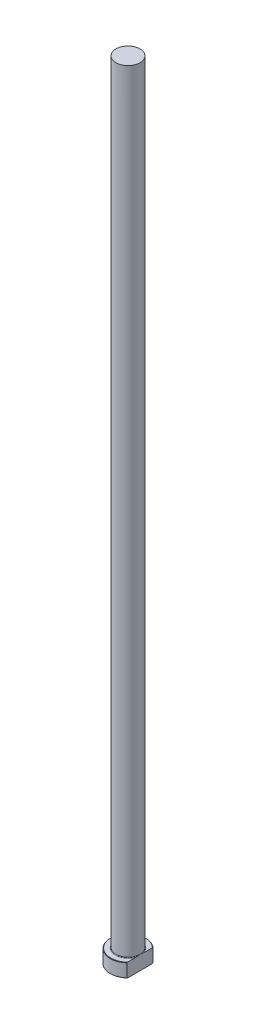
from build123d import *
from build123d.topology import SkipClean

# Parameters (mm, degrees)
CHAMFER1_SIZE = 0.2
FILLET1_R     = 0.3
KEY_DEPTH     = 401.202448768


with BuildPart() as part:
    # Sketch1 → Revolve1 (revolve)
    with BuildSketch(Plane.XY, mode=Mode.PRIVATE) as revolve1_sk:
        Polygon((0, 0), (-9, 0), (-9, 7), (-6.1, 7), (-6.1, 400), (0, 400), align=None)
    revolve(revolve1_sk.sketch.rotate(Axis((0, 259.958771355, 0), (0, -1, 0)), 270), axis=Axis((0, 259.958771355, 0), (0, -1, 0)))

    # Chamfer1
    chamfer1_edges = [part.edges().sort_by_distance(p)[0] for p in [
        (0, 7, -9),
        (0, 0, -9),
    ]]
    chamfer(chamfer1_edges, length=CHAMFER1_SIZE)

    # Fillet1
    fillet1_edges = [part.edges().sort_by_distance(p)[0] for p in [
        (0, 7, -6.1),
    ]]
    fillet(fillet1_edges, radius=FILLET1_R)

    # Sketch2 → KEY (cut, through all)
    with SkipClean():  # the faces are left unmerged after this step: merging them gives an invalid solid
        with BuildSketch(Plane(origin=(0, 0, 0), x_dir=(1, 0, 0), z_dir=(0, 1, 0))):
            with BuildLine():
                Line((6.1, 6.617401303), (6.1, -6.617401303))
                ThreePointArc((6.1, -6.617401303), (9, 0), (6.1, 6.617401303))
            make_face()
        extrude(amount=KEY_DEPTH, mode=Mode.SUBTRACT)


solid = part.part
